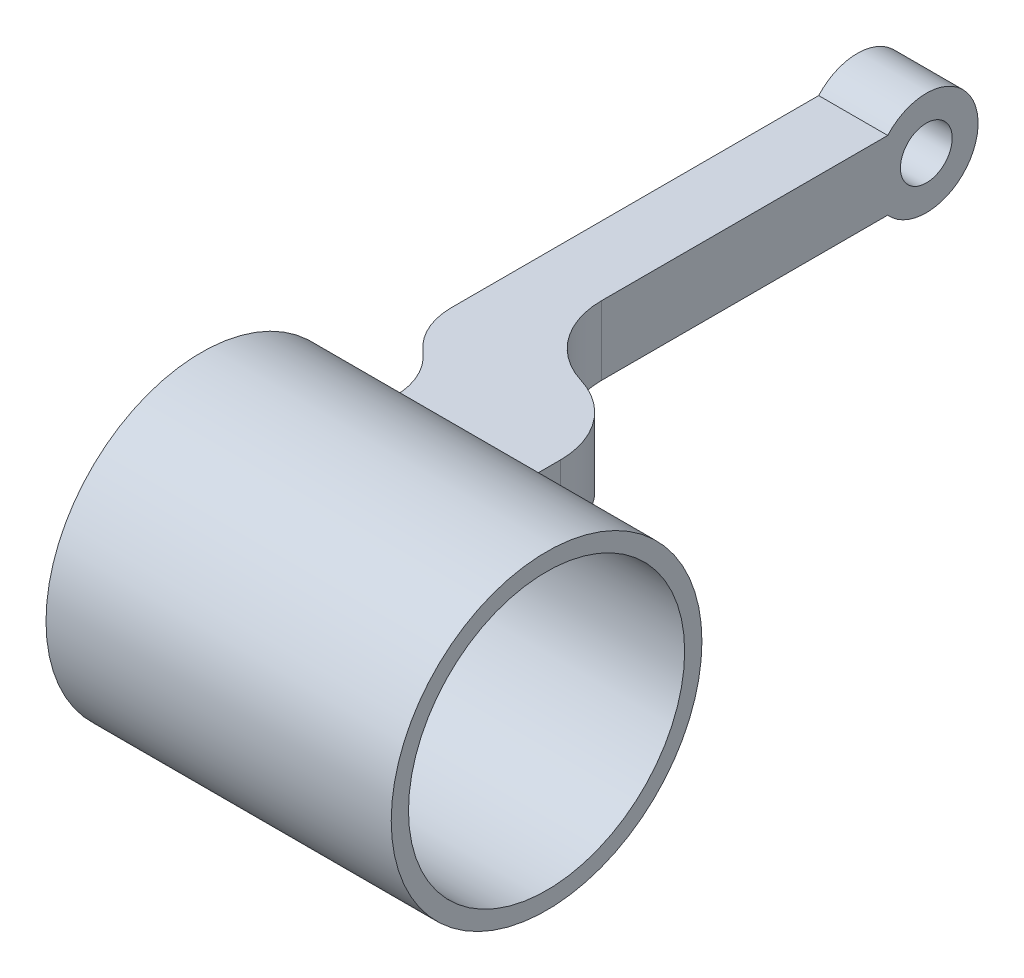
ISO-10303-21;
HEADER;
FILE_DESCRIPTION(('STEP AP214'),'2;1');
FILE_NAME('part.step','',(''),(''),'','','');
FILE_SCHEMA(('AUTOMOTIVE_DESIGN { 1 0 10303 214 1 1 1 1 }'));
ENDSEC;
DATA;
#1=APPLICATION_CONTEXT('core data for automotive mechanical design processes');
#2=APPLICATION_PROTOCOL_DEFINITION('international standard','automotive_design',2000,#1);
#3=PRODUCT_CONTEXT('',#1,'mechanical');
#4=PRODUCT('Part','Part','',(#3));
#5=PRODUCT_RELATED_PRODUCT_CATEGORY('part','',(#4));
#6=PRODUCT_DEFINITION_FORMATION('','',#4);
#7=PRODUCT_DEFINITION_CONTEXT('part definition',#1,'design');
#8=PRODUCT_DEFINITION('design','',#6,#7);
#9=PRODUCT_DEFINITION_SHAPE('','',#8);
#10=(LENGTH_UNIT() NAMED_UNIT(*) SI_UNIT(.MILLI.,.METRE.));
#11=(NAMED_UNIT(*) PLANE_ANGLE_UNIT() SI_UNIT($,.RADIAN.));
#12=(NAMED_UNIT(*) SI_UNIT($,.STERADIAN.) SOLID_ANGLE_UNIT());
#13=UNCERTAINTY_MEASURE_WITH_UNIT(LENGTH_MEASURE(1.E-05),#10,'distance_accuracy_value','');
#14=(GEOMETRIC_REPRESENTATION_CONTEXT(3) GLOBAL_UNCERTAINTY_ASSIGNED_CONTEXT((#13)) GLOBAL_UNIT_ASSIGNED_CONTEXT((#10,
#11,#12)) REPRESENTATION_CONTEXT('',''));
#15=CARTESIAN_POINT('',(0.,0.,0.));
#16=DIRECTION('',(0.,0.,1.));
#17=DIRECTION('',(1.,0.,0.));
#18=AXIS2_PLACEMENT_3D('',#15,#16,#17);
#19=CARTESIAN_POINT('',(12.7,6.35,-38.1));
#20=DIRECTION('',(0.,1.,0.));
#21=DIRECTION('',(0.,0.,1.));
#22=AXIS2_PLACEMENT_3D('',#19,#20,#21);
#23=PLANE('',#22);
#24=DIRECTION('',(0.,0.,-1.));
#25=VECTOR('',#24,1.);
#26=CARTESIAN_POINT('',(6.35,6.35,-67.2547303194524));
#27=LINE('',#26,#25);
#28=CARTESIAN_POINT('',(6.35,6.35,-67.2547303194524));
#29=VERTEX_POINT('',#28);
#30=CARTESIAN_POINT('',(6.35,6.34999999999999,-119.900484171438));
#31=VERTEX_POINT('',#30);
#32=EDGE_CURVE('E128',#29,#31,#27,.T.);
#33=ORIENTED_EDGE('',*,*,#32,.T.);
#34=DIRECTION('',(-1.,0.,0.));
#35=VECTOR('',#34,1.);
#36=CARTESIAN_POINT('',(6.35,6.35,-119.900484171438));
#37=LINE('',#36,#35);
#38=CARTESIAN_POINT('',(-6.35,6.35,-119.900484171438));
#39=VERTEX_POINT('',#38);
#40=EDGE_CURVE('E110',#31,#39,#37,.T.);
#41=ORIENTED_EDGE('',*,*,#40,.T.);
#42=DIRECTION('',(0.,0.,1.));
#43=VECTOR('',#42,1.);
#44=CARTESIAN_POINT('',(-6.35,6.35,-52.3223288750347));
#45=LINE('',#44,#43);
#46=CARTESIAN_POINT('',(-6.35,6.35,-52.3223288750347));
#47=VERTEX_POINT('',#46);
#48=EDGE_CURVE('E135',#39,#47,#45,.T.);
#49=ORIENTED_EDGE('',*,*,#48,.T.);
#50=CARTESIAN_POINT('',(6.35,6.35,-52.3223288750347));
#51=DIRECTION('',(0.,1.,0.));
#52=DIRECTION('',(0.,0.,-1.));
#53=AXIS2_PLACEMENT_3D('',#50,#51,#52);
#54=CIRCLE('',#53,12.7);
#55=CARTESIAN_POINT('',(-1.905,6.35,-42.6711644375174));
#56=VERTEX_POINT('',#55);
#57=EDGE_CURVE('E137',#47,#56,#54,.T.);
#58=ORIENTED_EDGE('',*,*,#57,.T.);
#59=CARTESIAN_POINT('',(-10.16,6.35,-33.02));
#60=DIRECTION('',(0.,-1.,0.));
#61=DIRECTION('',(0.,0.,1.));
#62=AXIS2_PLACEMENT_3D('',#59,#60,#61);
#63=CIRCLE('',#62,12.7);
#64=CARTESIAN_POINT('',(2.54,6.35,-33.02));
#65=VERTEX_POINT('',#64);
#66=EDGE_CURVE('E144',#56,#65,#63,.T.);
#67=ORIENTED_EDGE('',*,*,#66,.T.);
#68=DIRECTION('',(0.,0.,1.));
#69=VECTOR('',#68,1.);
#70=CARTESIAN_POINT('',(2.54,6.35,-25.4));
#71=LINE('',#70,#69);
#72=CARTESIAN_POINT('',(2.54,6.35,-27.86051192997));
#73=VERTEX_POINT('',#72);
#74=EDGE_CURVE('E146',#65,#73,#71,.T.);
#75=ORIENTED_EDGE('',*,*,#74,.T.);
#76=DIRECTION('',(-1.,0.,0.));
#77=VECTOR('',#76,1.);
#78=CARTESIAN_POINT('',(63.5,6.35,-27.86051192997));
#79=LINE('',#78,#77);
#80=CARTESIAN_POINT('',(27.94,6.35,-27.86051192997));
#81=VERTEX_POINT('',#80);
#82=EDGE_CURVE('E12',#81,#73,#79,.T.);
#83=ORIENTED_EDGE('',*,*,#82,.F.);
#84=DIRECTION('',(0.,0.,-1.));
#85=VECTOR('',#84,1.);
#86=CARTESIAN_POINT('',(27.94,6.35,-25.4));
#87=LINE('',#86,#85);
#88=CARTESIAN_POINT('',(27.94,6.35,-38.1));
#89=VERTEX_POINT('',#88);
#90=EDGE_CURVE('E165',#81,#89,#87,.T.);
#91=ORIENTED_EDGE('',*,*,#90,.T.);
#92=CARTESIAN_POINT('',(12.7,6.35,-38.1));
#93=DIRECTION('',(0.,1.,0.));
#94=DIRECTION('',(0.,0.,1.));
#95=AXIS2_PLACEMENT_3D('',#92,#93,#94);
#96=CIRCLE('',#95,15.24);
#97=CARTESIAN_POINT('',(17.145,6.35,-52.6773651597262));
#98=VERTEX_POINT('',#97);
#99=EDGE_CURVE('E139',#89,#98,#96,.T.);
#100=ORIENTED_EDGE('',*,*,#99,.T.);
#101=CARTESIAN_POINT('',(21.59,6.35,-67.2547303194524));
#102=DIRECTION('',(0.,-1.,0.));
#103=DIRECTION('',(0.,0.,-1.));
#104=AXIS2_PLACEMENT_3D('',#101,#102,#103);
#105=CIRCLE('',#104,15.24);
#106=EDGE_CURVE('E133',#98,#29,#105,.T.);
#107=ORIENTED_EDGE('',*,*,#106,.T.);
#108=EDGE_LOOP('',(#33,#41,#49,#58,#67,#75,#83,#91,#100,#107));
#109=FACE_BOUND('',#108,.T.);
#110=ADVANCED_FACE('F38',(#109),#23,.T.);
#111=CARTESIAN_POINT('',(12.7,-6.35,-38.1));
#112=DIRECTION('',(0.,1.,0.));
#113=DIRECTION('',(0.,0.,1.));
#114=AXIS2_PLACEMENT_3D('',#111,#112,#113);
#115=PLANE('',#114);
#116=DIRECTION('',(-1.,0.,0.));
#117=VECTOR('',#116,1.);
#118=CARTESIAN_POINT('',(6.35,-6.35,-119.900484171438));
#119=LINE('',#118,#117);
#120=CARTESIAN_POINT('',(6.35,-6.34999999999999,-119.900484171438));
#121=VERTEX_POINT('',#120);
#122=CARTESIAN_POINT('',(-6.35,-6.35,-119.900484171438));
#123=VERTEX_POINT('',#122);
#124=EDGE_CURVE('E121',#121,#123,#119,.T.);
#125=ORIENTED_EDGE('',*,*,#124,.F.);
#126=DIRECTION('',(0.,0.,-1.));
#127=VECTOR('',#126,1.);
#128=CARTESIAN_POINT('',(6.35,-6.35,-67.2547303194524));
#129=LINE('',#128,#127);
#130=CARTESIAN_POINT('',(6.35,-6.35,-67.2547303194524));
#131=VERTEX_POINT('',#130);
#132=EDGE_CURVE('E130',#131,#121,#129,.T.);
#133=ORIENTED_EDGE('',*,*,#132,.F.);
#134=CARTESIAN_POINT('',(21.59,-6.35,-67.2547303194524));
#135=DIRECTION('',(0.,-1.,0.));
#136=DIRECTION('',(0.,0.,-1.));
#137=AXIS2_PLACEMENT_3D('',#134,#135,#136);
#138=CIRCLE('',#137,15.24);
#139=CARTESIAN_POINT('',(17.145,-6.35,-52.6773651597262));
#140=VERTEX_POINT('',#139);
#141=EDGE_CURVE('E153',#140,#131,#138,.T.);
#142=ORIENTED_EDGE('',*,*,#141,.F.);
#143=CARTESIAN_POINT('',(12.7,-6.35,-38.1));
#144=DIRECTION('',(0.,1.,0.));
#145=DIRECTION('',(0.,0.,1.));
#146=AXIS2_PLACEMENT_3D('',#143,#144,#145);
#147=CIRCLE('',#146,15.24);
#148=CARTESIAN_POINT('',(27.94,-6.35,-38.1));
#149=VERTEX_POINT('',#148);
#150=EDGE_CURVE('E151',#149,#140,#147,.T.);
#151=ORIENTED_EDGE('',*,*,#150,.F.);
#152=DIRECTION('',(0.,0.,-1.));
#153=VECTOR('',#152,1.);
#154=CARTESIAN_POINT('',(27.94,-6.35,-25.4));
#155=LINE('',#154,#153);
#156=CARTESIAN_POINT('',(27.94,-6.35,-27.86051192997));
#157=VERTEX_POINT('',#156);
#158=EDGE_CURVE('E120',#157,#149,#155,.T.);
#159=ORIENTED_EDGE('',*,*,#158,.F.);
#160=DIRECTION('',(-1.,0.,0.));
#161=VECTOR('',#160,1.);
#162=CARTESIAN_POINT('',(63.5,-6.35,-27.86051192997));
#163=LINE('',#162,#161);
#164=CARTESIAN_POINT('',(2.54,-6.35,-27.86051192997));
#165=VERTEX_POINT('',#164);
#166=EDGE_CURVE('E46',#157,#165,#163,.T.);
#167=ORIENTED_EDGE('',*,*,#166,.T.);
#168=DIRECTION('',(0.,0.,1.));
#169=VECTOR('',#168,1.);
#170=CARTESIAN_POINT('',(2.54,-6.35,-25.4));
#171=LINE('',#170,#169);
#172=CARTESIAN_POINT('',(2.54,-6.35,-33.02));
#173=VERTEX_POINT('',#172);
#174=EDGE_CURVE('E162',#173,#165,#171,.T.);
#175=ORIENTED_EDGE('',*,*,#174,.F.);
#176=CARTESIAN_POINT('',(-10.16,-6.35,-33.02));
#177=DIRECTION('',(0.,-1.,0.));
#178=DIRECTION('',(0.,0.,1.));
#179=AXIS2_PLACEMENT_3D('',#176,#177,#178);
#180=CIRCLE('',#179,12.7);
#181=CARTESIAN_POINT('',(-1.905,-6.35,-42.6711644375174));
#182=VERTEX_POINT('',#181);
#183=EDGE_CURVE('E160',#182,#173,#180,.T.);
#184=ORIENTED_EDGE('',*,*,#183,.F.);
#185=CARTESIAN_POINT('',(6.35,-6.35,-52.3223288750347));
#186=DIRECTION('',(0.,1.,0.));
#187=DIRECTION('',(0.,0.,-1.));
#188=AXIS2_PLACEMENT_3D('',#185,#186,#187);
#189=CIRCLE('',#188,12.7);
#190=CARTESIAN_POINT('',(-6.35,-6.35,-52.3223288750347));
#191=VERTEX_POINT('',#190);
#192=EDGE_CURVE('E158',#191,#182,#189,.T.);
#193=ORIENTED_EDGE('',*,*,#192,.F.);
#194=DIRECTION('',(0.,0.,1.));
#195=VECTOR('',#194,1.);
#196=CARTESIAN_POINT('',(-6.35,-6.35,-52.3223288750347));
#197=LINE('',#196,#195);
#198=EDGE_CURVE('E156',#123,#191,#197,.T.);
#199=ORIENTED_EDGE('',*,*,#198,.F.);
#200=EDGE_LOOP('',(#125,#133,#142,#151,#159,#167,#175,#184,#193,#199));
#201=FACE_BOUND('',#200,.T.);
#202=ADVANCED_FACE('F200',(#201),#115,.F.);
#203=CARTESIAN_POINT('',(63.5,0.,0.));
#204=DIRECTION('',(1.,0.,0.));
#205=DIRECTION('',(0.,0.,-1.));
#206=AXIS2_PLACEMENT_3D('',#203,#204,#205);
#207=PLANE('',#206);
#208=CARTESIAN_POINT('',(63.5,0.,0.));
#209=DIRECTION('',(1.,0.,0.));
#210=DIRECTION('',(0.,0.,-1.));
#211=AXIS2_PLACEMENT_3D('',#208,#209,#210);
#212=CIRCLE('',#211,28.575);
#213=CARTESIAN_POINT('',(63.5,0.,-28.575));
#214=VERTEX_POINT('',#213);
#215=EDGE_CURVE('E192',#214,#214,#212,.T.);
#216=ORIENTED_EDGE('',*,*,#215,.T.);
#217=EDGE_LOOP('',(#216));
#218=FACE_BOUND('',#217,.T.);
#219=CARTESIAN_POINT('',(63.5,0.,0.));
#220=DIRECTION('',(1.,0.,0.));
#221=DIRECTION('',(0.,0.,-1.));
#222=AXIS2_PLACEMENT_3D('',#219,#220,#221);
#223=CIRCLE('',#222,25.4);
#224=CARTESIAN_POINT('',(63.5,0.,-25.4));
#225=VERTEX_POINT('',#224);
#226=EDGE_CURVE('E186',#225,#225,#223,.T.);
#227=ORIENTED_EDGE('',*,*,#226,.F.);
#228=EDGE_LOOP('',(#227));
#229=FACE_BOUND('',#228,.T.);
#230=ADVANCED_FACE('F249',(#218,#229),#207,.T.);
#231=CARTESIAN_POINT('',(0.,0.,0.));
#232=DIRECTION('',(1.,0.,0.));
#233=DIRECTION('',(0.,0.,-1.));
#234=AXIS2_PLACEMENT_3D('',#231,#232,#233);
#235=PLANE('',#234);
#236=CARTESIAN_POINT('',(0.,0.,0.));
#237=DIRECTION('',(1.,0.,0.));
#238=DIRECTION('',(0.,0.,-1.));
#239=AXIS2_PLACEMENT_3D('',#236,#237,#238);
#240=CIRCLE('',#239,28.575);
#241=CARTESIAN_POINT('',(0.,0.,-28.575));
#242=VERTEX_POINT('',#241);
#243=EDGE_CURVE('E189',#242,#242,#240,.T.);
#244=ORIENTED_EDGE('',*,*,#243,.F.);
#245=EDGE_LOOP('',(#244));
#246=FACE_BOUND('',#245,.T.);
#247=CARTESIAN_POINT('',(0.,0.,0.));
#248=DIRECTION('',(1.,0.,0.));
#249=DIRECTION('',(0.,0.,-1.));
#250=AXIS2_PLACEMENT_3D('',#247,#248,#249);
#251=CIRCLE('',#250,25.4);
#252=CARTESIAN_POINT('',(0.,0.,-25.4));
#253=VERTEX_POINT('',#252);
#254=EDGE_CURVE('E185',#253,#253,#251,.T.);
#255=ORIENTED_EDGE('',*,*,#254,.T.);
#256=EDGE_LOOP('',(#255));
#257=FACE_BOUND('',#256,.T.);
#258=ADVANCED_FACE('F334',(#246,#257),#235,.F.);
#259=CARTESIAN_POINT('',(63.5,0.,0.));
#260=DIRECTION('',(-1.,0.,0.));
#261=DIRECTION('',(0.,0.,1.));
#262=AXIS2_PLACEMENT_3D('',#259,#260,#261);
#263=CYLINDRICAL_SURFACE('',#262,28.575);
#264=CARTESIAN_POINT('',(27.94,0.,0.));
#265=DIRECTION('',(-1.,0.,0.));
#266=DIRECTION('',(0.,0.,1.));
#267=AXIS2_PLACEMENT_3D('',#264,#265,#266);
#268=CIRCLE('',#267,28.575);
#269=EDGE_CURVE('E52',#81,#157,#268,.T.);
#270=ORIENTED_EDGE('',*,*,#269,.F.);
#271=ORIENTED_EDGE('',*,*,#82,.T.);
#272=CARTESIAN_POINT('',(2.54,0.,0.));
#273=DIRECTION('',(1.,0.,0.));
#274=DIRECTION('',(0.,0.,-1.));
#275=AXIS2_PLACEMENT_3D('',#272,#273,#274);
#276=CIRCLE('',#275,28.575);
#277=EDGE_CURVE('E182',#165,#73,#276,.T.);
#278=ORIENTED_EDGE('',*,*,#277,.F.);
#279=ORIENTED_EDGE('',*,*,#166,.F.);
#280=EDGE_LOOP('',(#270,#271,#278,#279));
#281=FACE_BOUND('',#280,.T.);
#282=ORIENTED_EDGE('',*,*,#215,.F.);
#283=EDGE_LOOP('',(#282));
#284=FACE_BOUND('',#283,.T.);
#285=ORIENTED_EDGE('',*,*,#243,.T.);
#286=EDGE_LOOP('',(#285));
#287=FACE_BOUND('',#286,.T.);
#288=ADVANCED_FACE('F40',(#281,#284,#287),#263,.T.);
#289=CARTESIAN_POINT('',(63.5,0.,0.));
#290=DIRECTION('',(-1.,0.,0.));
#291=DIRECTION('',(0.,0.,1.));
#292=AXIS2_PLACEMENT_3D('',#289,#290,#291);
#293=CYLINDRICAL_SURFACE('',#292,25.4);
#294=ORIENTED_EDGE('',*,*,#226,.T.);
#295=EDGE_LOOP('',(#294));
#296=FACE_BOUND('',#295,.T.);
#297=ORIENTED_EDGE('',*,*,#254,.F.);
#298=EDGE_LOOP('',(#297));
#299=FACE_BOUND('',#298,.T.);
#300=ADVANCED_FACE('F315',(#296,#299),#293,.F.);
#301=CARTESIAN_POINT('',(27.94,6.35,-25.4));
#302=DIRECTION('',(-1.,0.,0.));
#303=DIRECTION('',(0.,0.,1.));
#304=AXIS2_PLACEMENT_3D('',#301,#302,#303);
#305=PLANE('',#304);
#306=ORIENTED_EDGE('',*,*,#90,.F.);
#307=ORIENTED_EDGE('',*,*,#269,.T.);
#308=ORIENTED_EDGE('',*,*,#158,.T.);
#309=DIRECTION('',(0.,-1.,0.));
#310=VECTOR('',#309,1.);
#311=CARTESIAN_POINT('',(27.94,6.35,-38.1));
#312=LINE('',#311,#310);
#313=EDGE_CURVE('E179',#89,#149,#312,.T.);
#314=ORIENTED_EDGE('',*,*,#313,.F.);
#315=EDGE_LOOP('',(#306,#307,#308,#314));
#316=FACE_BOUND('',#315,.T.);
#317=ADVANCED_FACE('F256',(#316),#305,.F.);
#318=CARTESIAN_POINT('',(2.54,6.35,-25.4));
#319=DIRECTION('',(1.,0.,0.));
#320=DIRECTION('',(0.,0.,-1.));
#321=AXIS2_PLACEMENT_3D('',#318,#319,#320);
#322=PLANE('',#321);
#323=ORIENTED_EDGE('',*,*,#174,.T.);
#324=ORIENTED_EDGE('',*,*,#277,.T.);
#325=ORIENTED_EDGE('',*,*,#74,.F.);
#326=DIRECTION('',(0.,-1.,0.));
#327=VECTOR('',#326,1.);
#328=CARTESIAN_POINT('',(2.54,6.35,-33.02));
#329=LINE('',#328,#327);
#330=EDGE_CURVE('E149',#65,#173,#329,.T.);
#331=ORIENTED_EDGE('',*,*,#330,.T.);
#332=EDGE_LOOP('',(#323,#324,#325,#331));
#333=FACE_BOUND('',#332,.T.);
#334=ADVANCED_FACE('F204',(#333),#322,.F.);
#335=CARTESIAN_POINT('',(12.7,6.35,-38.1));
#336=DIRECTION('',(0.,-1.,0.));
#337=DIRECTION('',(0.,0.,-1.));
#338=AXIS2_PLACEMENT_3D('',#335,#336,#337);
#339=CYLINDRICAL_SURFACE('',#338,15.24);
#340=ORIENTED_EDGE('',*,*,#150,.T.);
#341=DIRECTION('',(0.,-1.,0.));
#342=VECTOR('',#341,1.);
#343=CARTESIAN_POINT('',(17.145,6.35,-52.6773651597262));
#344=LINE('',#343,#342);
#345=EDGE_CURVE('E176',#98,#140,#344,.T.);
#346=ORIENTED_EDGE('',*,*,#345,.F.);
#347=ORIENTED_EDGE('',*,*,#99,.F.);
#348=ORIENTED_EDGE('',*,*,#313,.T.);
#349=EDGE_LOOP('',(#340,#346,#347,#348));
#350=FACE_BOUND('',#349,.T.);
#351=ADVANCED_FACE('F231',(#350),#339,.T.);
#352=CARTESIAN_POINT('',(21.59,6.35,-67.2547303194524));
#353=DIRECTION('',(0.,-1.,0.));
#354=DIRECTION('',(0.,0.,-1.));
#355=AXIS2_PLACEMENT_3D('',#352,#353,#354);
#356=CYLINDRICAL_SURFACE('',#355,15.24);
#357=ORIENTED_EDGE('',*,*,#141,.T.);
#358=DIRECTION('',(0.,-1.,0.));
#359=VECTOR('',#358,1.);
#360=CARTESIAN_POINT('',(6.35,6.35,-67.2547303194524));
#361=LINE('',#360,#359);
#362=EDGE_CURVE('E174',#29,#131,#361,.T.);
#363=ORIENTED_EDGE('',*,*,#362,.F.);
#364=ORIENTED_EDGE('',*,*,#106,.F.);
#365=ORIENTED_EDGE('',*,*,#345,.T.);
#366=EDGE_LOOP('',(#357,#363,#364,#365));
#367=FACE_BOUND('',#366,.T.);
#368=ADVANCED_FACE('F234',(#367),#356,.F.);
#369=CARTESIAN_POINT('',(6.35,6.35,-67.2547303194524));
#370=DIRECTION('',(-1.,0.,0.));
#371=DIRECTION('',(0.,0.,1.));
#372=AXIS2_PLACEMENT_3D('',#369,#370,#371);
#373=PLANE('',#372);
#374=CARTESIAN_POINT('',(6.35,0.,-127.));
#375=DIRECTION('',(-1.,0.,0.));
#376=DIRECTION('',(0.,0.,1.));
#377=AXIS2_PLACEMENT_3D('',#374,#375,#376);
#378=CIRCLE('',#377,4.76250000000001);
#379=CARTESIAN_POINT('',(6.35,0.,-122.2375));
#380=VERTEX_POINT('',#379);
#381=EDGE_CURVE('E219',#380,#380,#378,.T.);
#382=ORIENTED_EDGE('',*,*,#381,.T.);
#383=EDGE_LOOP('',(#382));
#384=FACE_BOUND('',#383,.T.);
#385=CARTESIAN_POINT('',(6.35,0.,-127.));
#386=DIRECTION('',(1.,0.,0.));
#387=DIRECTION('',(0.,0.,-1.));
#388=AXIS2_PLACEMENT_3D('',#385,#386,#387);
#389=CIRCLE('',#388,9.525);
#390=EDGE_CURVE('E113',#121,#31,#389,.T.);
#391=ORIENTED_EDGE('',*,*,#390,.T.);
#392=ORIENTED_EDGE('',*,*,#32,.F.);
#393=ORIENTED_EDGE('',*,*,#362,.T.);
#394=ORIENTED_EDGE('',*,*,#132,.T.);
#395=EDGE_LOOP('',(#391,#392,#393,#394));
#396=FACE_BOUND('',#395,.T.);
#397=ADVANCED_FACE('F126',(#384,#396),#373,.F.);
#398=CARTESIAN_POINT('',(-6.35,6.35,-52.3223288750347));
#399=DIRECTION('',(1.,0.,0.));
#400=DIRECTION('',(0.,0.,-1.));
#401=AXIS2_PLACEMENT_3D('',#398,#399,#400);
#402=PLANE('',#401);
#403=CARTESIAN_POINT('',(-6.35,0.,-127.));
#404=DIRECTION('',(1.,0.,0.));
#405=DIRECTION('',(0.,0.,-1.));
#406=AXIS2_PLACEMENT_3D('',#403,#404,#405);
#407=CIRCLE('',#406,4.76250000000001);
#408=CARTESIAN_POINT('',(-6.35,0.,-131.7625));
#409=VERTEX_POINT('',#408);
#410=EDGE_CURVE('E222',#409,#409,#407,.T.);
#411=ORIENTED_EDGE('',*,*,#410,.T.);
#412=EDGE_LOOP('',(#411));
#413=FACE_BOUND('',#412,.T.);
#414=ORIENTED_EDGE('',*,*,#48,.F.);
#415=CARTESIAN_POINT('',(-6.35,0.,-127.));
#416=DIRECTION('',(1.,0.,0.));
#417=DIRECTION('',(0.,0.,-1.));
#418=AXIS2_PLACEMENT_3D('',#415,#416,#417);
#419=CIRCLE('',#418,9.525);
#420=EDGE_CURVE('E116',#123,#39,#419,.T.);
#421=ORIENTED_EDGE('',*,*,#420,.F.);
#422=ORIENTED_EDGE('',*,*,#198,.T.);
#423=DIRECTION('',(0.,-1.,0.));
#424=VECTOR('',#423,1.);
#425=CARTESIAN_POINT('',(-6.35,6.35,-52.3223288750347));
#426=LINE('',#425,#424);
#427=EDGE_CURVE('E171',#47,#191,#426,.T.);
#428=ORIENTED_EDGE('',*,*,#427,.F.);
#429=EDGE_LOOP('',(#414,#421,#422,#428));
#430=FACE_BOUND('',#429,.T.);
#431=ADVANCED_FACE('F218',(#413,#430),#402,.F.);
#432=CARTESIAN_POINT('',(6.35,6.35,-52.3223288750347));
#433=DIRECTION('',(0.,-1.,0.));
#434=DIRECTION('',(0.,0.,-1.));
#435=AXIS2_PLACEMENT_3D('',#432,#433,#434);
#436=CYLINDRICAL_SURFACE('',#435,12.7);
#437=ORIENTED_EDGE('',*,*,#192,.T.);
#438=DIRECTION('',(0.,-1.,0.));
#439=VECTOR('',#438,1.);
#440=CARTESIAN_POINT('',(-1.905,6.35,-42.6711644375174));
#441=LINE('',#440,#439);
#442=EDGE_CURVE('E168',#56,#182,#441,.T.);
#443=ORIENTED_EDGE('',*,*,#442,.F.);
#444=ORIENTED_EDGE('',*,*,#57,.F.);
#445=ORIENTED_EDGE('',*,*,#427,.T.);
#446=EDGE_LOOP('',(#437,#443,#444,#445));
#447=FACE_BOUND('',#446,.T.);
#448=ADVANCED_FACE('F214',(#447),#436,.T.);
#449=CARTESIAN_POINT('',(-10.16,6.35,-33.02));
#450=DIRECTION('',(0.,-1.,0.));
#451=DIRECTION('',(0.,0.,-1.));
#452=AXIS2_PLACEMENT_3D('',#449,#450,#451);
#453=CYLINDRICAL_SURFACE('',#452,12.7);
#454=ORIENTED_EDGE('',*,*,#183,.T.);
#455=ORIENTED_EDGE('',*,*,#330,.F.);
#456=ORIENTED_EDGE('',*,*,#66,.F.);
#457=ORIENTED_EDGE('',*,*,#442,.T.);
#458=EDGE_LOOP('',(#454,#455,#456,#457));
#459=FACE_BOUND('',#458,.T.);
#460=ADVANCED_FACE('F209',(#459),#453,.F.);
#461=CARTESIAN_POINT('',(6.35,0.,-127.));
#462=DIRECTION('',(-1.,0.,0.));
#463=DIRECTION('',(0.,0.,1.));
#464=AXIS2_PLACEMENT_3D('',#461,#462,#463);
#465=CYLINDRICAL_SURFACE('',#464,9.525);
#466=ORIENTED_EDGE('',*,*,#40,.F.);
#467=ORIENTED_EDGE('',*,*,#390,.F.);
#468=ORIENTED_EDGE('',*,*,#124,.T.);
#469=ORIENTED_EDGE('',*,*,#420,.T.);
#470=EDGE_LOOP('',(#466,#467,#468,#469));
#471=FACE_BOUND('',#470,.T.);
#472=ADVANCED_FACE('F112',(#471),#465,.T.);
#473=CARTESIAN_POINT('',(-6.35,0.,-127.));
#474=DIRECTION('',(1.,0.,0.));
#475=DIRECTION('',(0.,0.,-1.));
#476=AXIS2_PLACEMENT_3D('',#473,#474,#475);
#477=CYLINDRICAL_SURFACE('',#476,4.76250000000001);
#478=ORIENTED_EDGE('',*,*,#410,.F.);
#479=EDGE_LOOP('',(#478));
#480=FACE_BOUND('',#479,.T.);
#481=ORIENTED_EDGE('',*,*,#381,.F.);
#482=EDGE_LOOP('',(#481));
#483=FACE_BOUND('',#482,.T.);
#484=ADVANCED_FACE('F269',(#480,#483),#477,.F.);
#485=CLOSED_SHELL('',(#110,#202,#230,#258,#288,#300,#317,#334,#351,#368,#397,#431,#448,#460,
#472,#484));
#486=MANIFOLD_SOLID_BREP('B2',#485);
#487=ADVANCED_BREP_SHAPE_REPRESENTATION('',(#18,#486),#14);
#488=SHAPE_DEFINITION_REPRESENTATION(#9,#487);
ENDSEC;
END-ISO-10303-21;
